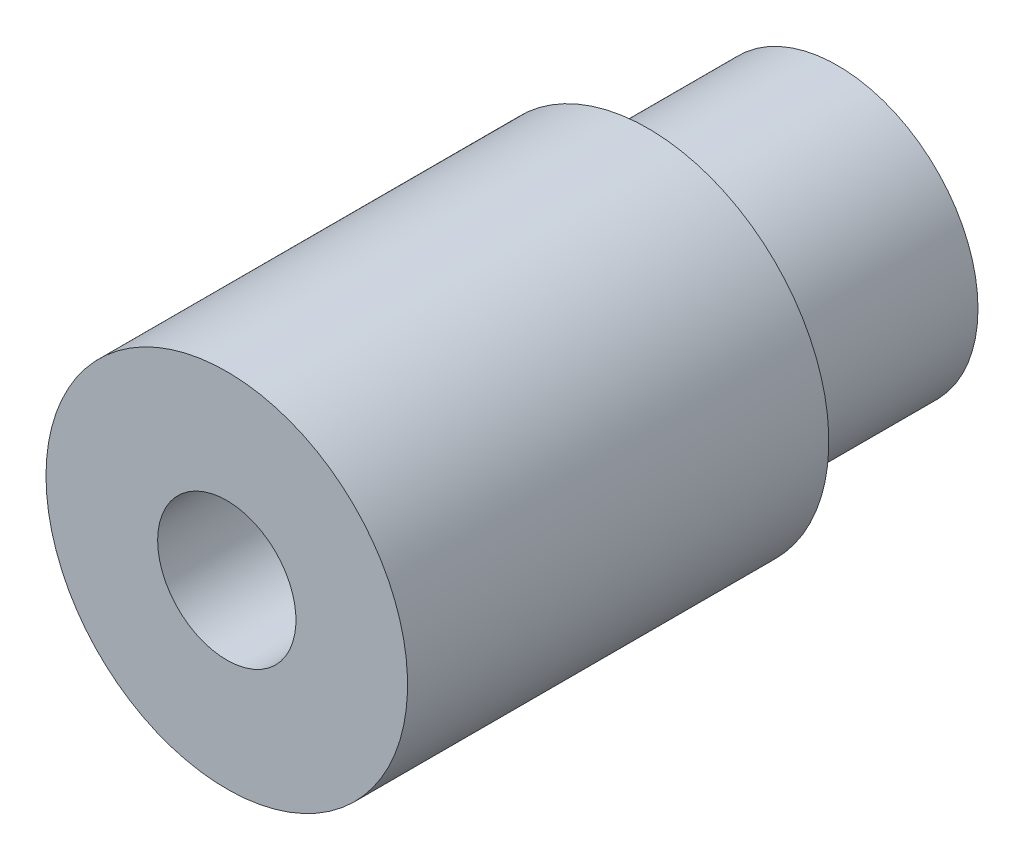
ISO-10303-21;
HEADER;
FILE_DESCRIPTION(('STEP AP214'),'2;1');
FILE_NAME('part.step','',(''),(''),'','','');
FILE_SCHEMA(('AUTOMOTIVE_DESIGN { 1 0 10303 214 1 1 1 1 }'));
ENDSEC;
DATA;
#1=APPLICATION_CONTEXT('core data for automotive mechanical design processes');
#2=APPLICATION_PROTOCOL_DEFINITION('international standard','automotive_design',2000,#1);
#3=PRODUCT_CONTEXT('',#1,'mechanical');
#4=PRODUCT('Part','Part','',(#3));
#5=PRODUCT_RELATED_PRODUCT_CATEGORY('part','',(#4));
#6=PRODUCT_DEFINITION_FORMATION('','',#4);
#7=PRODUCT_DEFINITION_CONTEXT('part definition',#1,'design');
#8=PRODUCT_DEFINITION('design','',#6,#7);
#9=PRODUCT_DEFINITION_SHAPE('','',#8);
#10=(LENGTH_UNIT() NAMED_UNIT(*) SI_UNIT(.MILLI.,.METRE.));
#11=(NAMED_UNIT(*) PLANE_ANGLE_UNIT() SI_UNIT($,.RADIAN.));
#12=(NAMED_UNIT(*) SI_UNIT($,.STERADIAN.) SOLID_ANGLE_UNIT());
#13=UNCERTAINTY_MEASURE_WITH_UNIT(LENGTH_MEASURE(1.E-05),#10,'distance_accuracy_value','');
#14=(GEOMETRIC_REPRESENTATION_CONTEXT(3) GLOBAL_UNCERTAINTY_ASSIGNED_CONTEXT((#13)) GLOBAL_UNIT_ASSIGNED_CONTEXT((#10,
#11,#12)) REPRESENTATION_CONTEXT('',''));
#15=CARTESIAN_POINT('',(0.,0.,0.));
#16=DIRECTION('',(0.,0.,1.));
#17=DIRECTION('',(1.,0.,0.));
#18=AXIS2_PLACEMENT_3D('',#15,#16,#17);
#19=CARTESIAN_POINT('',(0.,0.,-83.4064547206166));
#20=DIRECTION('',(0.,0.,-1.));
#21=DIRECTION('',(-1.,0.,0.));
#22=AXIS2_PLACEMENT_3D('',#19,#20,#21);
#23=CYLINDRICAL_SURFACE('',#22,5.07999999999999);
#24=CARTESIAN_POINT('',(0.,0.,21.526363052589));
#25=DIRECTION('',(0.,0.,-1.));
#26=DIRECTION('',(-1.,0.,0.));
#27=AXIS2_PLACEMENT_3D('',#24,#25,#26);
#28=CIRCLE('',#27,5.07999999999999);
#29=CARTESIAN_POINT('',(-5.07999999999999,0.,21.526363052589));
#30=VERTEX_POINT('',#29);
#31=EDGE_CURVE('E53',#30,#30,#28,.T.);
#32=ORIENTED_EDGE('',*,*,#31,.T.);
#33=EDGE_LOOP('',(#32));
#34=FACE_BOUND('',#33,.T.);
#35=CARTESIAN_POINT('',(0.,0.,14.668363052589));
#36=DIRECTION('',(0.,0.,-1.));
#37=DIRECTION('',(-1.,0.,0.));
#38=AXIS2_PLACEMENT_3D('',#35,#36,#37);
#39=CIRCLE('',#38,5.07999999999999);
#40=CARTESIAN_POINT('',(-5.07999999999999,0.,14.668363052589));
#41=VERTEX_POINT('',#40);
#42=EDGE_CURVE('E10',#41,#41,#39,.T.);
#43=ORIENTED_EDGE('',*,*,#42,.F.);
#44=EDGE_LOOP('',(#43));
#45=FACE_BOUND('',#44,.T.);
#46=ADVANCED_FACE('F31',(#34,#45),#23,.T.);
#47=CARTESIAN_POINT('',(-5.07999999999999,0.,14.668363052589));
#48=DIRECTION('',(0.,0.,-1.));
#49=DIRECTION('',(-1.,0.,0.));
#50=AXIS2_PLACEMENT_3D('',#47,#48,#49);
#51=PLANE('',#50);
#52=ORIENTED_EDGE('',*,*,#42,.T.);
#53=EDGE_LOOP('',(#52));
#54=FACE_BOUND('',#53,.T.);
#55=CARTESIAN_POINT('',(0.,0.,14.668363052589));
#56=DIRECTION('',(0.,0.,-1.));
#57=DIRECTION('',(-1.,0.,0.));
#58=AXIS2_PLACEMENT_3D('',#55,#56,#57);
#59=CIRCLE('',#58,2.50189999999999);
#60=CARTESIAN_POINT('',(-2.50189999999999,0.,14.668363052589));
#61=VERTEX_POINT('',#60);
#62=EDGE_CURVE('E37',#61,#61,#59,.T.);
#63=ORIENTED_EDGE('',*,*,#62,.F.);
#64=EDGE_LOOP('',(#63));
#65=FACE_BOUND('',#64,.T.);
#66=ADVANCED_FACE('F71',(#54,#65),#51,.T.);
#67=CARTESIAN_POINT('',(0.,0.,-83.4064547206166));
#68=DIRECTION('',(0.,0.,-1.));
#69=DIRECTION('',(-1.,0.,0.));
#70=AXIS2_PLACEMENT_3D('',#67,#68,#69);
#71=CYLINDRICAL_SURFACE('',#70,2.50189999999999);
#72=ORIENTED_EDGE('',*,*,#62,.T.);
#73=EDGE_LOOP('',(#72));
#74=FACE_BOUND('',#73,.T.);
#75=CARTESIAN_POINT('',(0.,0.,36.766363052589));
#76=DIRECTION('',(0.,0.,-1.));
#77=DIRECTION('',(-1.,0.,0.));
#78=AXIS2_PLACEMENT_3D('',#75,#76,#77);
#79=CIRCLE('',#78,2.50189999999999);
#80=CARTESIAN_POINT('',(-2.50189999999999,0.,36.766363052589));
#81=VERTEX_POINT('',#80);
#82=EDGE_CURVE('E41',#81,#81,#79,.T.);
#83=ORIENTED_EDGE('',*,*,#82,.F.);
#84=EDGE_LOOP('',(#83));
#85=FACE_BOUND('',#84,.T.);
#86=ADVANCED_FACE('F75',(#74,#85),#71,.F.);
#87=CARTESIAN_POINT('',(-2.50189999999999,0.,36.766363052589));
#88=DIRECTION('',(0.,0.,1.));
#89=DIRECTION('',(1.,0.,0.));
#90=AXIS2_PLACEMENT_3D('',#87,#88,#89);
#91=PLANE('',#90);
#92=ORIENTED_EDGE('',*,*,#82,.T.);
#93=EDGE_LOOP('',(#92));
#94=FACE_BOUND('',#93,.T.);
#95=CARTESIAN_POINT('',(0.,0.,36.766363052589));
#96=DIRECTION('',(0.,0.,-1.));
#97=DIRECTION('',(-1.,0.,0.));
#98=AXIS2_PLACEMENT_3D('',#95,#96,#97);
#99=CIRCLE('',#98,6.54049999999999);
#100=CARTESIAN_POINT('',(-6.54049999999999,0.,36.766363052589));
#101=VERTEX_POINT('',#100);
#102=EDGE_CURVE('E45',#101,#101,#99,.T.);
#103=ORIENTED_EDGE('',*,*,#102,.F.);
#104=EDGE_LOOP('',(#103));
#105=FACE_BOUND('',#104,.T.);
#106=ADVANCED_FACE('F67',(#94,#105),#91,.T.);
#107=CARTESIAN_POINT('',(0.,0.,-83.4064547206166));
#108=DIRECTION('',(0.,0.,-1.));
#109=DIRECTION('',(-1.,0.,0.));
#110=AXIS2_PLACEMENT_3D('',#107,#108,#109);
#111=CYLINDRICAL_SURFACE('',#110,6.54049999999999);
#112=ORIENTED_EDGE('',*,*,#102,.T.);
#113=EDGE_LOOP('',(#112));
#114=FACE_BOUND('',#113,.T.);
#115=CARTESIAN_POINT('',(0.,0.,21.526363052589));
#116=DIRECTION('',(0.,0.,-1.));
#117=DIRECTION('',(-1.,0.,0.));
#118=AXIS2_PLACEMENT_3D('',#115,#116,#117);
#119=CIRCLE('',#118,6.54049999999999);
#120=CARTESIAN_POINT('',(-6.54049999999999,0.,21.526363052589));
#121=VERTEX_POINT('',#120);
#122=EDGE_CURVE('E50',#121,#121,#119,.T.);
#123=ORIENTED_EDGE('',*,*,#122,.F.);
#124=EDGE_LOOP('',(#123));
#125=FACE_BOUND('',#124,.T.);
#126=ADVANCED_FACE('F61',(#114,#125),#111,.T.);
#127=CARTESIAN_POINT('',(-6.54049999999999,0.,21.526363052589));
#128=DIRECTION('',(0.,0.,-1.));
#129=DIRECTION('',(-1.,0.,0.));
#130=AXIS2_PLACEMENT_3D('',#127,#128,#129);
#131=PLANE('',#130);
#132=ORIENTED_EDGE('',*,*,#122,.T.);
#133=EDGE_LOOP('',(#132));
#134=FACE_BOUND('',#133,.T.);
#135=ORIENTED_EDGE('',*,*,#31,.F.);
#136=EDGE_LOOP('',(#135));
#137=FACE_BOUND('',#136,.T.);
#138=ADVANCED_FACE('F59',(#134,#137),#131,.T.);
#139=CLOSED_SHELL('',(#46,#66,#86,#106,#126,#138));
#140=MANIFOLD_SOLID_BREP('B2',#139);
#141=ADVANCED_BREP_SHAPE_REPRESENTATION('',(#18,#140),#14);
#142=SHAPE_DEFINITION_REPRESENTATION(#9,#141);
ENDSEC;
END-ISO-10303-21;
